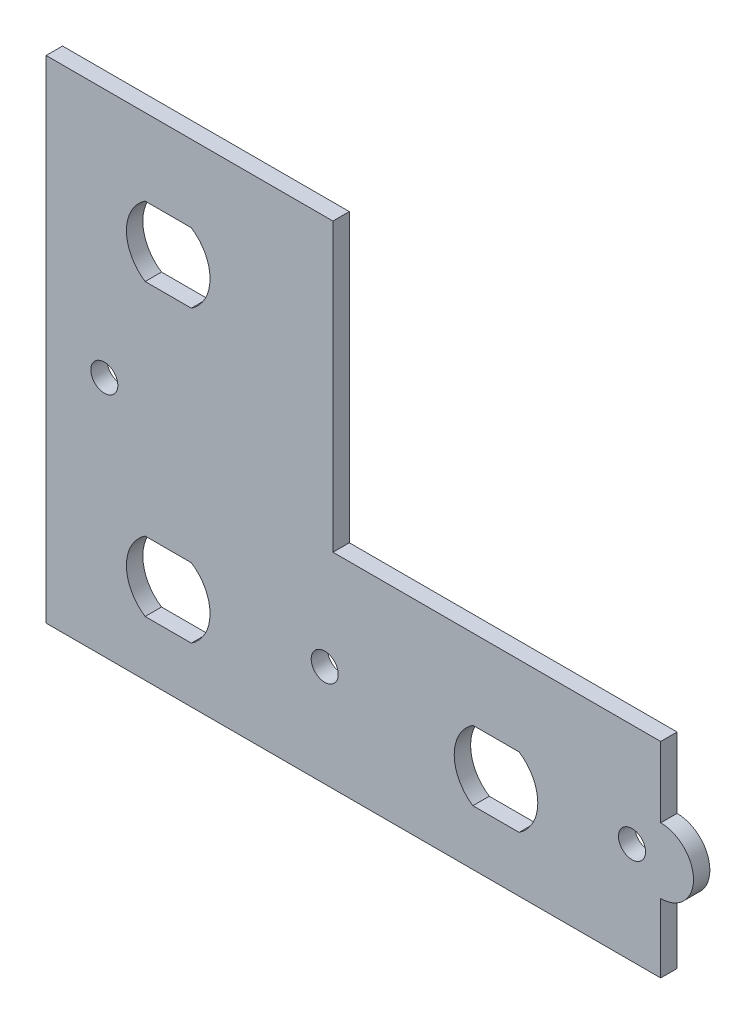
ISO-10303-21;
HEADER;
FILE_DESCRIPTION(('STEP AP214'),'2;1');
FILE_NAME('part.step','',(''),(''),'','','');
FILE_SCHEMA(('AUTOMOTIVE_DESIGN { 1 0 10303 214 1 1 1 1 }'));
ENDSEC;
DATA;
#1=APPLICATION_CONTEXT('core data for automotive mechanical design processes');
#2=APPLICATION_PROTOCOL_DEFINITION('international standard','automotive_design',2000,#1);
#3=PRODUCT_CONTEXT('',#1,'mechanical');
#4=PRODUCT('Part','Part','',(#3));
#5=PRODUCT_RELATED_PRODUCT_CATEGORY('part','',(#4));
#6=PRODUCT_DEFINITION_FORMATION('','',#4);
#7=PRODUCT_DEFINITION_CONTEXT('part definition',#1,'design');
#8=PRODUCT_DEFINITION('design','',#6,#7);
#9=PRODUCT_DEFINITION_SHAPE('','',#8);
#10=(LENGTH_UNIT() NAMED_UNIT(*) SI_UNIT(.MILLI.,.METRE.));
#11=(NAMED_UNIT(*) PLANE_ANGLE_UNIT() SI_UNIT($,.RADIAN.));
#12=(NAMED_UNIT(*) SI_UNIT($,.STERADIAN.) SOLID_ANGLE_UNIT());
#13=UNCERTAINTY_MEASURE_WITH_UNIT(LENGTH_MEASURE(1.E-05),#10,'distance_accuracy_value','');
#14=(GEOMETRIC_REPRESENTATION_CONTEXT(3) GLOBAL_UNCERTAINTY_ASSIGNED_CONTEXT((#13)) GLOBAL_UNIT_ASSIGNED_CONTEXT((#10,
#11,#12)) REPRESENTATION_CONTEXT('',''));
#15=CARTESIAN_POINT('',(0.,0.,0.));
#16=DIRECTION('',(0.,0.,1.));
#17=DIRECTION('',(1.,0.,0.));
#18=AXIS2_PLACEMENT_3D('',#15,#16,#17);
#19=CARTESIAN_POINT('',(75.,-27.3592901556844,-16.1023866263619));
#20=DIRECTION('',(-1.,0.,0.));
#21=DIRECTION('',(0.,0.,1.));
#22=AXIS2_PLACEMENT_3D('',#19,#20,#21);
#23=PLANE('',#22);
#24=DIRECTION('',(0.,-1.,0.));
#25=VECTOR('',#24,1.);
#26=CARTESIAN_POINT('',(75.,32.6407098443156,-18.1023866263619));
#27=LINE('',#26,#25);
#28=CARTESIAN_POINT('',(75.,-18.9592901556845,-18.1023866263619));
#29=VERTEX_POINT('',#28);
#30=CARTESIAN_POINT('',(75.,-27.3592901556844,-18.1023866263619));
#31=VERTEX_POINT('',#30);
#32=EDGE_CURVE('E62',#29,#31,#27,.T.);
#33=ORIENTED_EDGE('',*,*,#32,.F.);
#34=DIRECTION('',(0.,0.,1.));
#35=VECTOR('',#34,1.);
#36=CARTESIAN_POINT('',(75.,-18.9592901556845,-18.1023866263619));
#37=LINE('',#36,#35);
#38=CARTESIAN_POINT('',(75.,-18.9592901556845,-16.1023866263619));
#39=VERTEX_POINT('',#38);
#40=EDGE_CURVE('E185',#29,#39,#37,.T.);
#41=ORIENTED_EDGE('',*,*,#40,.T.);
#42=DIRECTION('',(0.,-1.,0.));
#43=VECTOR('',#42,1.);
#44=CARTESIAN_POINT('',(75.,32.6407098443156,-16.1023866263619));
#45=LINE('',#44,#43);
#46=CARTESIAN_POINT('',(75.,-27.3592901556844,-16.1023866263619));
#47=VERTEX_POINT('',#46);
#48=EDGE_CURVE('E177',#39,#47,#45,.T.);
#49=ORIENTED_EDGE('',*,*,#48,.T.);
#50=DIRECTION('',(0.,0.,1.));
#51=VECTOR('',#50,1.);
#52=CARTESIAN_POINT('',(75.,-27.3592901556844,-18.1023866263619));
#53=LINE('',#52,#51);
#54=EDGE_CURVE('E282',#31,#47,#53,.T.);
#55=ORIENTED_EDGE('',*,*,#54,.F.);
#56=EDGE_LOOP('',(#33,#41,#49,#55));
#57=FACE_BOUND('',#56,.T.);
#58=ADVANCED_FACE('F37',(#57),#23,.F.);
#59=CARTESIAN_POINT('',(75.,32.6407098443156,-16.1023866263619));
#60=DIRECTION('',(0.,0.,-1.));
#61=DIRECTION('',(0.,1.,0.));
#62=AXIS2_PLACEMENT_3D('',#59,#60,#61);
#63=PLANE('',#62);
#64=CARTESIAN_POINT('',(71.5,-14.9592901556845,-16.1023866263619));
#65=DIRECTION('',(0.,0.,1.));
#66=DIRECTION('',(1.,0.,0.));
#67=AXIS2_PLACEMENT_3D('',#64,#65,#66);
#68=CIRCLE('',#67,1.65);
#69=CARTESIAN_POINT('',(73.15,-14.9592901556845,-16.1023866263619));
#70=VERTEX_POINT('',#69);
#71=EDGE_CURVE('E189',#70,#70,#68,.T.);
#72=ORIENTED_EDGE('',*,*,#71,.F.);
#73=EDGE_LOOP('',(#72));
#74=FACE_BOUND('',#73,.T.);
#75=CARTESIAN_POINT('',(34.,-14.9592901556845,-16.1023866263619));
#76=DIRECTION('',(0.,0.,1.));
#77=DIRECTION('',(1.,0.,0.));
#78=AXIS2_PLACEMENT_3D('',#75,#76,#77);
#79=CIRCLE('',#78,1.65);
#80=CARTESIAN_POINT('',(35.65,-14.9592901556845,-16.1023866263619));
#81=VERTEX_POINT('',#80);
#82=EDGE_CURVE('E200',#81,#81,#79,.T.);
#83=ORIENTED_EDGE('',*,*,#82,.F.);
#84=EDGE_LOOP('',(#83));
#85=FACE_BOUND('',#84,.T.);
#86=DIRECTION('',(1.,0.,0.));
#87=VECTOR('',#86,1.);
#88=CARTESIAN_POINT('',(52.0808689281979,-20.6092901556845,-16.1023866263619));
#89=LINE('',#88,#87);
#90=CARTESIAN_POINT('',(52.0808689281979,-20.6092901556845,-16.1023866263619));
#91=VERTEX_POINT('',#90);
#92=CARTESIAN_POINT('',(57.7191310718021,-20.6092901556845,-16.1023866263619));
#93=VERTEX_POINT('',#92);
#94=EDGE_CURVE('E206',#91,#93,#89,.T.);
#95=ORIENTED_EDGE('',*,*,#94,.F.);
#96=CARTESIAN_POINT('',(54.9,-16.3592901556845,-16.1023866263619));
#97=DIRECTION('',(0.,0.,1.));
#98=DIRECTION('',(1.,0.,0.));
#99=AXIS2_PLACEMENT_3D('',#96,#97,#98);
#100=CIRCLE('',#99,5.1);
#101=CARTESIAN_POINT('',(52.0808689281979,-12.1092901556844,-16.1023866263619));
#102=VERTEX_POINT('',#101);
#103=EDGE_CURVE('E204',#102,#91,#100,.T.);
#104=ORIENTED_EDGE('',*,*,#103,.F.);
#105=DIRECTION('',(-1.,0.,0.));
#106=VECTOR('',#105,1.);
#107=CARTESIAN_POINT('',(52.0808689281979,-12.1092901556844,-16.1023866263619));
#108=LINE('',#107,#106);
#109=CARTESIAN_POINT('',(57.7191310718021,-12.1092901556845,-16.1023866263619));
#110=VERTEX_POINT('',#109);
#111=EDGE_CURVE('E212',#110,#102,#108,.T.);
#112=ORIENTED_EDGE('',*,*,#111,.F.);
#113=CARTESIAN_POINT('',(54.9,-16.3592901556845,-16.1023866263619));
#114=DIRECTION('',(0.,0.,1.));
#115=DIRECTION('',(1.,0.,0.));
#116=AXIS2_PLACEMENT_3D('',#113,#114,#115);
#117=CIRCLE('',#116,5.1);
#118=EDGE_CURVE('E209',#93,#110,#117,.T.);
#119=ORIENTED_EDGE('',*,*,#118,.F.);
#120=EDGE_LOOP('',(#95,#104,#112,#119));
#121=FACE_BOUND('',#120,.T.);
#122=DIRECTION('',(1.,0.,0.));
#123=VECTOR('',#122,1.);
#124=CARTESIAN_POINT('',(12.0808689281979,-20.6092901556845,-16.1023866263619));
#125=LINE('',#124,#123);
#126=CARTESIAN_POINT('',(12.0808689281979,-20.6092901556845,-16.1023866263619));
#127=VERTEX_POINT('',#126);
#128=CARTESIAN_POINT('',(17.7191310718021,-20.6092901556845,-16.1023866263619));
#129=VERTEX_POINT('',#128);
#130=EDGE_CURVE('E226',#127,#129,#125,.T.);
#131=ORIENTED_EDGE('',*,*,#130,.F.);
#132=CARTESIAN_POINT('',(14.9,-16.3592901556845,-16.1023866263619));
#133=DIRECTION('',(0.,0.,1.));
#134=DIRECTION('',(1.,0.,0.));
#135=AXIS2_PLACEMENT_3D('',#132,#133,#134);
#136=CIRCLE('',#135,5.1);
#137=CARTESIAN_POINT('',(12.0808689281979,-12.1092901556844,-16.1023866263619));
#138=VERTEX_POINT('',#137);
#139=EDGE_CURVE('E218',#138,#127,#136,.T.);
#140=ORIENTED_EDGE('',*,*,#139,.F.);
#141=DIRECTION('',(-1.,0.,0.));
#142=VECTOR('',#141,1.);
#143=CARTESIAN_POINT('',(12.0808689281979,-12.1092901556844,-16.1023866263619));
#144=LINE('',#143,#142);
#145=CARTESIAN_POINT('',(17.7191310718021,-12.1092901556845,-16.1023866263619));
#146=VERTEX_POINT('',#145);
#147=EDGE_CURVE('E232',#146,#138,#144,.T.);
#148=ORIENTED_EDGE('',*,*,#147,.F.);
#149=CARTESIAN_POINT('',(14.9,-16.3592901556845,-16.1023866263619));
#150=DIRECTION('',(0.,0.,1.));
#151=DIRECTION('',(1.,0.,0.));
#152=AXIS2_PLACEMENT_3D('',#149,#150,#151);
#153=CIRCLE('',#152,5.1);
#154=EDGE_CURVE('E229',#129,#146,#153,.T.);
#155=ORIENTED_EDGE('',*,*,#154,.F.);
#156=EDGE_LOOP('',(#131,#140,#148,#155));
#157=FACE_BOUND('',#156,.T.);
#158=CARTESIAN_POINT('',(7.1,2.14070984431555,-16.1023866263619));
#159=DIRECTION('',(0.,0.,1.));
#160=DIRECTION('',(1.,0.,0.));
#161=AXIS2_PLACEMENT_3D('',#158,#159,#160);
#162=CIRCLE('',#161,1.65);
#163=CARTESIAN_POINT('',(8.75,2.14070984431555,-16.1023866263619));
#164=VERTEX_POINT('',#163);
#165=EDGE_CURVE('E238',#164,#164,#162,.T.);
#166=ORIENTED_EDGE('',*,*,#165,.F.);
#167=EDGE_LOOP('',(#166));
#168=FACE_BOUND('',#167,.T.);
#169=DIRECTION('',(1.,0.,0.));
#170=VECTOR('',#169,1.);
#171=CARTESIAN_POINT('',(12.0808689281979,14.7907098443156,-16.1023866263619));
#172=LINE('',#171,#170);
#173=CARTESIAN_POINT('',(12.0808689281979,14.7907098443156,-16.1023866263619));
#174=VERTEX_POINT('',#173);
#175=CARTESIAN_POINT('',(17.7191310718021,14.7907098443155,-16.1023866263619));
#176=VERTEX_POINT('',#175);
#177=EDGE_CURVE('E250',#174,#176,#172,.T.);
#178=ORIENTED_EDGE('',*,*,#177,.F.);
#179=CARTESIAN_POINT('',(14.9,19.0407098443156,-16.1023866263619));
#180=DIRECTION('',(0.,0.,1.));
#181=DIRECTION('',(1.,0.,0.));
#182=AXIS2_PLACEMENT_3D('',#179,#180,#181);
#183=CIRCLE('',#182,5.1);
#184=CARTESIAN_POINT('',(12.0808689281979,23.2907098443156,-16.1023866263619));
#185=VERTEX_POINT('',#184);
#186=EDGE_CURVE('E248',#185,#174,#183,.T.);
#187=ORIENTED_EDGE('',*,*,#186,.F.);
#188=DIRECTION('',(-1.,0.,0.));
#189=VECTOR('',#188,1.);
#190=CARTESIAN_POINT('',(12.0808689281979,23.2907098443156,-16.1023866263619));
#191=LINE('',#190,#189);
#192=CARTESIAN_POINT('',(17.7191310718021,23.2907098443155,-16.1023866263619));
#193=VERTEX_POINT('',#192);
#194=EDGE_CURVE('E256',#193,#185,#191,.T.);
#195=ORIENTED_EDGE('',*,*,#194,.F.);
#196=CARTESIAN_POINT('',(14.9,19.0407098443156,-16.1023866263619));
#197=DIRECTION('',(0.,0.,1.));
#198=DIRECTION('',(1.,0.,0.));
#199=AXIS2_PLACEMENT_3D('',#196,#197,#198);
#200=CIRCLE('',#199,5.1);
#201=EDGE_CURVE('E253',#176,#193,#200,.T.);
#202=ORIENTED_EDGE('',*,*,#201,.F.);
#203=EDGE_LOOP('',(#178,#187,#195,#202));
#204=FACE_BOUND('',#203,.T.);
#205=CARTESIAN_POINT('',(75.,-2.35929015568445,-16.1023866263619));
#206=VERTEX_POINT('',#205);
#207=CARTESIAN_POINT('',(75.,-10.9592901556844,-16.1023866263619));
#208=VERTEX_POINT('',#207);
#209=EDGE_CURVE('E54',#206,#208,#45,.T.);
#210=ORIENTED_EDGE('',*,*,#209,.F.);
#211=DIRECTION('',(1.,0.,0.));
#212=VECTOR('',#211,1.);
#213=CARTESIAN_POINT('',(75.,-2.35929015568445,-16.1023866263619));
#214=LINE('',#213,#212);
#215=CARTESIAN_POINT('',(35.,-2.35929015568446,-16.1023866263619));
#216=VERTEX_POINT('',#215);
#217=EDGE_CURVE('E271',#216,#206,#214,.T.);
#218=ORIENTED_EDGE('',*,*,#217,.F.);
#219=DIRECTION('',(0.,-1.,0.));
#220=VECTOR('',#219,1.);
#221=CARTESIAN_POINT('',(35.,-2.35929015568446,-16.1023866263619));
#222=LINE('',#221,#220);
#223=CARTESIAN_POINT('',(35.,32.6407098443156,-16.1023866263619));
#224=VERTEX_POINT('',#223);
#225=EDGE_CURVE('E262',#224,#216,#222,.T.);
#226=ORIENTED_EDGE('',*,*,#225,.F.);
#227=DIRECTION('',(-1.,0.,0.));
#228=VECTOR('',#227,1.);
#229=CARTESIAN_POINT('',(75.,32.6407098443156,-16.1023866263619));
#230=LINE('',#229,#228);
#231=CARTESIAN_POINT('',(0.,32.6407098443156,-16.1023866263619));
#232=VERTEX_POINT('',#231);
#233=EDGE_CURVE('E287',#224,#232,#230,.T.);
#234=ORIENTED_EDGE('',*,*,#233,.T.);
#235=DIRECTION('',(0.,-1.,0.));
#236=VECTOR('',#235,1.);
#237=CARTESIAN_POINT('',(0.,32.6407098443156,-16.1023866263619));
#238=LINE('',#237,#236);
#239=CARTESIAN_POINT('',(0.,-27.3592901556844,-16.1023866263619));
#240=VERTEX_POINT('',#239);
#241=EDGE_CURVE('E280',#232,#240,#238,.T.);
#242=ORIENTED_EDGE('',*,*,#241,.T.);
#243=DIRECTION('',(-1.,0.,0.));
#244=VECTOR('',#243,1.);
#245=CARTESIAN_POINT('',(75.,-27.3592901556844,-16.1023866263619));
#246=LINE('',#245,#244);
#247=EDGE_CURVE('E181',#47,#240,#246,.T.);
#248=ORIENTED_EDGE('',*,*,#247,.F.);
#249=ORIENTED_EDGE('',*,*,#48,.F.);
#250=CARTESIAN_POINT('',(75.,-14.9592901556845,-16.1023866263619));
#251=DIRECTION('',(0.,0.,1.));
#252=DIRECTION('',(1.,0.,0.));
#253=AXIS2_PLACEMENT_3D('',#250,#251,#252);
#254=CIRCLE('',#253,4.);
#255=EDGE_CURVE('E179',#39,#208,#254,.T.);
#256=ORIENTED_EDGE('',*,*,#255,.T.);
#257=EDGE_LOOP('',(#210,#218,#226,#234,#242,#248,#249,#256));
#258=FACE_BOUND('',#257,.T.);
#259=ADVANCED_FACE('F39',(#74,#85,#121,#157,#168,#204,#258),#63,.F.);
#260=CARTESIAN_POINT('',(75.,-27.3592901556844,-18.1023866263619));
#261=DIRECTION('',(0.,-1.,0.));
#262=DIRECTION('',(0.,0.,-1.));
#263=AXIS2_PLACEMENT_3D('',#260,#261,#262);
#264=PLANE('',#263);
#265=DIRECTION('',(0.,0.,1.));
#266=VECTOR('',#265,1.);
#267=CARTESIAN_POINT('',(0.,-27.3592901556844,-18.1023866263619));
#268=LINE('',#267,#266);
#269=CARTESIAN_POINT('',(0.,-27.3592901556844,-18.1023866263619));
#270=VERTEX_POINT('',#269);
#271=EDGE_CURVE('E289',#270,#240,#268,.T.);
#272=ORIENTED_EDGE('',*,*,#271,.F.);
#273=DIRECTION('',(-1.,0.,0.));
#274=VECTOR('',#273,1.);
#275=CARTESIAN_POINT('',(75.,-27.3592901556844,-18.1023866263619));
#276=LINE('',#275,#274);
#277=EDGE_CURVE('E300',#31,#270,#276,.T.);
#278=ORIENTED_EDGE('',*,*,#277,.F.);
#279=ORIENTED_EDGE('',*,*,#54,.T.);
#280=ORIENTED_EDGE('',*,*,#247,.T.);
#281=EDGE_LOOP('',(#272,#278,#279,#280));
#282=FACE_BOUND('',#281,.T.);
#283=ADVANCED_FACE('F340',(#282),#264,.T.);
#284=CARTESIAN_POINT('',(75.,32.6407098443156,-18.1023866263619));
#285=DIRECTION('',(0.,0.,-1.));
#286=DIRECTION('',(0.,1.,0.));
#287=AXIS2_PLACEMENT_3D('',#284,#285,#286);
#288=PLANE('',#287);
#289=CARTESIAN_POINT('',(71.5,-14.9592901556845,-18.1023866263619));
#290=DIRECTION('',(0.,0.,-1.));
#291=DIRECTION('',(0.,1.,0.));
#292=AXIS2_PLACEMENT_3D('',#289,#290,#291);
#293=CIRCLE('',#292,1.65);
#294=CARTESIAN_POINT('',(71.5,-13.3092901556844,-18.1023866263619));
#295=VERTEX_POINT('',#294);
#296=EDGE_CURVE('E41',#295,#295,#293,.T.);
#297=ORIENTED_EDGE('',*,*,#296,.F.);
#298=EDGE_LOOP('',(#297));
#299=FACE_BOUND('',#298,.T.);
#300=CARTESIAN_POINT('',(34.,-14.9592901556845,-18.1023866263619));
#301=DIRECTION('',(0.,0.,-1.));
#302=DIRECTION('',(0.,1.,0.));
#303=AXIS2_PLACEMENT_3D('',#300,#301,#302);
#304=CIRCLE('',#303,1.65);
#305=CARTESIAN_POINT('',(34.,-13.3092901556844,-18.1023866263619));
#306=VERTEX_POINT('',#305);
#307=EDGE_CURVE('E203',#306,#306,#304,.T.);
#308=ORIENTED_EDGE('',*,*,#307,.F.);
#309=EDGE_LOOP('',(#308));
#310=FACE_BOUND('',#309,.T.);
#311=CARTESIAN_POINT('',(54.9,-16.3592901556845,-18.1023866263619));
#312=DIRECTION('',(0.,0.,-1.));
#313=DIRECTION('',(0.,1.,0.));
#314=AXIS2_PLACEMENT_3D('',#311,#312,#313);
#315=CIRCLE('',#314,5.1);
#316=CARTESIAN_POINT('',(52.0808689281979,-20.6092901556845,-18.1023866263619));
#317=VERTEX_POINT('',#316);
#318=CARTESIAN_POINT('',(52.0808689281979,-12.1092901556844,-18.1023866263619));
#319=VERTEX_POINT('',#318);
#320=EDGE_CURVE('E11',#317,#319,#315,.T.);
#321=ORIENTED_EDGE('',*,*,#320,.F.);
#322=DIRECTION('',(-1.,0.,0.));
#323=VECTOR('',#322,1.);
#324=CARTESIAN_POINT('',(75.,-20.6092901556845,-18.1023866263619));
#325=LINE('',#324,#323);
#326=CARTESIAN_POINT('',(57.7191310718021,-20.6092901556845,-18.1023866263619));
#327=VERTEX_POINT('',#326);
#328=EDGE_CURVE('E325',#327,#317,#325,.T.);
#329=ORIENTED_EDGE('',*,*,#328,.F.);
#330=CARTESIAN_POINT('',(54.9,-16.3592901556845,-18.1023866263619));
#331=DIRECTION('',(0.,0.,-1.));
#332=DIRECTION('',(0.,1.,0.));
#333=AXIS2_PLACEMENT_3D('',#330,#331,#332);
#334=CIRCLE('',#333,5.1);
#335=CARTESIAN_POINT('',(57.7191310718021,-12.1092901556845,-18.1023866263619));
#336=VERTEX_POINT('',#335);
#337=EDGE_CURVE('E327',#336,#327,#334,.T.);
#338=ORIENTED_EDGE('',*,*,#337,.F.);
#339=DIRECTION('',(1.,0.,0.));
#340=VECTOR('',#339,1.);
#341=CARTESIAN_POINT('',(75.,-12.1092901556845,-18.1023866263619));
#342=LINE('',#341,#340);
#343=EDGE_CURVE('E46',#319,#336,#342,.T.);
#344=ORIENTED_EDGE('',*,*,#343,.F.);
#345=EDGE_LOOP('',(#321,#329,#338,#344));
#346=FACE_BOUND('',#345,.T.);
#347=CARTESIAN_POINT('',(14.9,-16.3592901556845,-18.1023866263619));
#348=DIRECTION('',(0.,0.,-1.));
#349=DIRECTION('',(0.,1.,0.));
#350=AXIS2_PLACEMENT_3D('',#347,#348,#349);
#351=CIRCLE('',#350,5.1);
#352=CARTESIAN_POINT('',(12.0808689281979,-20.6092901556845,-18.1023866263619));
#353=VERTEX_POINT('',#352);
#354=CARTESIAN_POINT('',(12.0808689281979,-12.1092901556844,-18.1023866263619));
#355=VERTEX_POINT('',#354);
#356=EDGE_CURVE('E323',#353,#355,#351,.T.);
#357=ORIENTED_EDGE('',*,*,#356,.F.);
#358=DIRECTION('',(-1.,0.,0.));
#359=VECTOR('',#358,1.);
#360=CARTESIAN_POINT('',(75.,-20.6092901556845,-18.1023866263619));
#361=LINE('',#360,#359);
#362=CARTESIAN_POINT('',(17.7191310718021,-20.6092901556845,-18.1023866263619));
#363=VERTEX_POINT('',#362);
#364=EDGE_CURVE('E314',#363,#353,#361,.T.);
#365=ORIENTED_EDGE('',*,*,#364,.F.);
#366=CARTESIAN_POINT('',(14.9,-16.3592901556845,-18.1023866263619));
#367=DIRECTION('',(0.,0.,-1.));
#368=DIRECTION('',(0.,1.,0.));
#369=AXIS2_PLACEMENT_3D('',#366,#367,#368);
#370=CIRCLE('',#369,5.1);
#371=CARTESIAN_POINT('',(17.7191310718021,-12.1092901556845,-18.1023866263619));
#372=VERTEX_POINT('',#371);
#373=EDGE_CURVE('E318',#372,#363,#370,.T.);
#374=ORIENTED_EDGE('',*,*,#373,.F.);
#375=DIRECTION('',(1.,0.,0.));
#376=VECTOR('',#375,1.);
#377=CARTESIAN_POINT('',(75.,-12.1092901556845,-18.1023866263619));
#378=LINE('',#377,#376);
#379=EDGE_CURVE('E321',#355,#372,#378,.T.);
#380=ORIENTED_EDGE('',*,*,#379,.F.);
#381=EDGE_LOOP('',(#357,#365,#374,#380));
#382=FACE_BOUND('',#381,.T.);
#383=CARTESIAN_POINT('',(7.1,2.14070984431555,-18.1023866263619));
#384=DIRECTION('',(0.,0.,-1.));
#385=DIRECTION('',(0.,1.,0.));
#386=AXIS2_PLACEMENT_3D('',#383,#384,#385);
#387=CIRCLE('',#386,1.65);
#388=CARTESIAN_POINT('',(7.1,3.79070984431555,-18.1023866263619));
#389=VERTEX_POINT('',#388);
#390=EDGE_CURVE('E247',#389,#389,#387,.T.);
#391=ORIENTED_EDGE('',*,*,#390,.F.);
#392=EDGE_LOOP('',(#391));
#393=FACE_BOUND('',#392,.T.);
#394=CARTESIAN_POINT('',(14.9,19.0407098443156,-18.1023866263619));
#395=DIRECTION('',(0.,0.,-1.));
#396=DIRECTION('',(0.,1.,0.));
#397=AXIS2_PLACEMENT_3D('',#394,#395,#396);
#398=CIRCLE('',#397,5.1);
#399=CARTESIAN_POINT('',(12.0808689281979,14.7907098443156,-18.1023866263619));
#400=VERTEX_POINT('',#399);
#401=CARTESIAN_POINT('',(12.0808689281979,23.2907098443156,-18.1023866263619));
#402=VERTEX_POINT('',#401);
#403=EDGE_CURVE('E312',#400,#402,#398,.T.);
#404=ORIENTED_EDGE('',*,*,#403,.F.);
#405=DIRECTION('',(-1.,0.,0.));
#406=VECTOR('',#405,1.);
#407=CARTESIAN_POINT('',(75.,14.7907098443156,-18.1023866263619));
#408=LINE('',#407,#406);
#409=CARTESIAN_POINT('',(17.7191310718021,14.7907098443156,-18.1023866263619));
#410=VERTEX_POINT('',#409);
#411=EDGE_CURVE('E305',#410,#400,#408,.T.);
#412=ORIENTED_EDGE('',*,*,#411,.F.);
#413=CARTESIAN_POINT('',(14.9,19.0407098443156,-18.1023866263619));
#414=DIRECTION('',(0.,0.,-1.));
#415=DIRECTION('',(0.,1.,0.));
#416=AXIS2_PLACEMENT_3D('',#413,#414,#415);
#417=CIRCLE('',#416,5.1);
#418=CARTESIAN_POINT('',(17.7191310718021,23.2907098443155,-18.1023866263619));
#419=VERTEX_POINT('',#418);
#420=EDGE_CURVE('E307',#419,#410,#417,.T.);
#421=ORIENTED_EDGE('',*,*,#420,.F.);
#422=DIRECTION('',(1.,0.,0.));
#423=VECTOR('',#422,1.);
#424=CARTESIAN_POINT('',(75.,23.2907098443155,-18.1023866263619));
#425=LINE('',#424,#423);
#426=EDGE_CURVE('E310',#402,#419,#425,.T.);
#427=ORIENTED_EDGE('',*,*,#426,.F.);
#428=EDGE_LOOP('',(#404,#412,#421,#427));
#429=FACE_BOUND('',#428,.T.);
#430=DIRECTION('',(-1.,0.,0.));
#431=VECTOR('',#430,1.);
#432=CARTESIAN_POINT('',(75.,-2.35929015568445,-18.1023866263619));
#433=LINE('',#432,#431);
#434=CARTESIAN_POINT('',(75.,-2.35929015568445,-18.1023866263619));
#435=VERTEX_POINT('',#434);
#436=CARTESIAN_POINT('',(35.,-2.35929015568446,-18.1023866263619));
#437=VERTEX_POINT('',#436);
#438=EDGE_CURVE('E276',#435,#437,#433,.T.);
#439=ORIENTED_EDGE('',*,*,#438,.F.);
#440=CARTESIAN_POINT('',(75.,-10.9592901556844,-18.1023866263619));
#441=VERTEX_POINT('',#440);
#442=EDGE_CURVE('E284',#435,#441,#27,.T.);
#443=ORIENTED_EDGE('',*,*,#442,.T.);
#444=CARTESIAN_POINT('',(75.,-14.9592901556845,-18.1023866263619));
#445=DIRECTION('',(0.,0.,1.));
#446=DIRECTION('',(1.,0.,0.));
#447=AXIS2_PLACEMENT_3D('',#444,#445,#446);
#448=CIRCLE('',#447,4.);
#449=EDGE_CURVE('E193',#29,#441,#448,.T.);
#450=ORIENTED_EDGE('',*,*,#449,.F.);
#451=ORIENTED_EDGE('',*,*,#32,.T.);
#452=ORIENTED_EDGE('',*,*,#277,.T.);
#453=DIRECTION('',(0.,-1.,0.));
#454=VECTOR('',#453,1.);
#455=CARTESIAN_POINT('',(0.,32.6407098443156,-18.1023866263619));
#456=LINE('',#455,#454);
#457=CARTESIAN_POINT('',(0.,32.6407098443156,-18.1023866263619));
#458=VERTEX_POINT('',#457);
#459=EDGE_CURVE('E292',#458,#270,#456,.T.);
#460=ORIENTED_EDGE('',*,*,#459,.F.);
#461=DIRECTION('',(-1.,0.,0.));
#462=VECTOR('',#461,1.);
#463=CARTESIAN_POINT('',(75.,32.6407098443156,-18.1023866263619));
#464=LINE('',#463,#462);
#465=CARTESIAN_POINT('',(35.,32.6407098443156,-18.1023866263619));
#466=VERTEX_POINT('',#465);
#467=EDGE_CURVE('E298',#466,#458,#464,.T.);
#468=ORIENTED_EDGE('',*,*,#467,.F.);
#469=DIRECTION('',(0.,1.,0.));
#470=VECTOR('',#469,1.);
#471=CARTESIAN_POINT('',(35.,32.6407098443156,-18.1023866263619));
#472=LINE('',#471,#470);
#473=EDGE_CURVE('E279',#437,#466,#472,.T.);
#474=ORIENTED_EDGE('',*,*,#473,.F.);
#475=EDGE_LOOP('',(#439,#443,#450,#451,#452,#460,#468,#474));
#476=FACE_BOUND('',#475,.T.);
#477=ADVANCED_FACE('F336',(#299,#310,#346,#382,#393,#429,#476),#288,.T.);
#478=CARTESIAN_POINT('',(75.,32.6407098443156,-16.1023866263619));
#479=DIRECTION('',(0.,1.,0.));
#480=DIRECTION('',(0.,0.,1.));
#481=AXIS2_PLACEMENT_3D('',#478,#479,#480);
#482=PLANE('',#481);
#483=DIRECTION('',(0.,0.,1.));
#484=VECTOR('',#483,1.);
#485=CARTESIAN_POINT('',(35.,32.6407098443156,-26.1023866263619));
#486=LINE('',#485,#484);
#487=EDGE_CURVE('E273',#466,#224,#486,.T.);
#488=ORIENTED_EDGE('',*,*,#487,.F.);
#489=ORIENTED_EDGE('',*,*,#467,.T.);
#490=DIRECTION('',(0.,0.,-1.));
#491=VECTOR('',#490,1.);
#492=CARTESIAN_POINT('',(0.,32.6407098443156,-16.1023866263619));
#493=LINE('',#492,#491);
#494=EDGE_CURVE('E183',#232,#458,#493,.T.);
#495=ORIENTED_EDGE('',*,*,#494,.F.);
#496=ORIENTED_EDGE('',*,*,#233,.F.);
#497=EDGE_LOOP('',(#488,#489,#495,#496));
#498=FACE_BOUND('',#497,.T.);
#499=ADVANCED_FACE('F339',(#498),#482,.T.);
#500=ORIENTED_EDGE('',*,*,#209,.T.);
#501=DIRECTION('',(0.,0.,1.));
#502=VECTOR('',#501,1.);
#503=CARTESIAN_POINT('',(75.,-10.9592901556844,-18.1023866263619));
#504=LINE('',#503,#502);
#505=EDGE_CURVE('E190',#441,#208,#504,.T.);
#506=ORIENTED_EDGE('',*,*,#505,.F.);
#507=ORIENTED_EDGE('',*,*,#442,.F.);
#508=DIRECTION('',(0.,0.,1.));
#509=VECTOR('',#508,1.);
#510=CARTESIAN_POINT('',(75.,-2.35929015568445,-16.1023866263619));
#511=LINE('',#510,#509);
#512=EDGE_CURVE('E303',#435,#206,#511,.T.);
#513=ORIENTED_EDGE('',*,*,#512,.T.);
#514=EDGE_LOOP('',(#500,#506,#507,#513));
#515=FACE_BOUND('',#514,.T.);
#516=ADVANCED_FACE('F363',(#515),#23,.F.);
#517=CARTESIAN_POINT('',(0.,-27.3592901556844,-16.1023866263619));
#518=DIRECTION('',(-1.,0.,0.));
#519=DIRECTION('',(0.,0.,1.));
#520=AXIS2_PLACEMENT_3D('',#517,#518,#519);
#521=PLANE('',#520);
#522=ORIENTED_EDGE('',*,*,#241,.F.);
#523=ORIENTED_EDGE('',*,*,#494,.T.);
#524=ORIENTED_EDGE('',*,*,#459,.T.);
#525=ORIENTED_EDGE('',*,*,#271,.T.);
#526=EDGE_LOOP('',(#522,#523,#524,#525));
#527=FACE_BOUND('',#526,.T.);
#528=ADVANCED_FACE('F378',(#527),#521,.T.);
#529=CARTESIAN_POINT('',(75.,-2.35929015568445,-26.1023866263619));
#530=DIRECTION('',(0.,-1.,0.));
#531=DIRECTION('',(1.,0.,0.));
#532=AXIS2_PLACEMENT_3D('',#529,#530,#531);
#533=PLANE('',#532);
#534=ORIENTED_EDGE('',*,*,#438,.T.);
#535=DIRECTION('',(0.,0.,1.));
#536=VECTOR('',#535,1.);
#537=CARTESIAN_POINT('',(35.,-2.35929015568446,-26.1023866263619));
#538=LINE('',#537,#536);
#539=EDGE_CURVE('E274',#437,#216,#538,.T.);
#540=ORIENTED_EDGE('',*,*,#539,.T.);
#541=ORIENTED_EDGE('',*,*,#217,.T.);
#542=ORIENTED_EDGE('',*,*,#512,.F.);
#543=EDGE_LOOP('',(#534,#540,#541,#542));
#544=FACE_BOUND('',#543,.T.);
#545=ADVANCED_FACE('F367',(#544),#533,.F.);
#546=CARTESIAN_POINT('',(35.,-2.35929015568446,-26.1023866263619));
#547=DIRECTION('',(-1.,0.,0.));
#548=DIRECTION('',(0.,0.,1.));
#549=AXIS2_PLACEMENT_3D('',#546,#547,#548);
#550=PLANE('',#549);
#551=ORIENTED_EDGE('',*,*,#473,.T.);
#552=ORIENTED_EDGE('',*,*,#487,.T.);
#553=ORIENTED_EDGE('',*,*,#225,.T.);
#554=ORIENTED_EDGE('',*,*,#539,.F.);
#555=EDGE_LOOP('',(#551,#552,#553,#554));
#556=FACE_BOUND('',#555,.T.);
#557=ADVANCED_FACE('F369',(#556),#550,.F.);
#558=CARTESIAN_POINT('',(14.9,19.0407098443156,-26.1023866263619));
#559=DIRECTION('',(0.,0.,1.));
#560=DIRECTION('',(1.,0.,0.));
#561=AXIS2_PLACEMENT_3D('',#558,#559,#560);
#562=CYLINDRICAL_SURFACE('',#561,5.1);
#563=ORIENTED_EDGE('',*,*,#403,.T.);
#564=DIRECTION('',(0.,0.,1.));
#565=VECTOR('',#564,1.);
#566=CARTESIAN_POINT('',(12.0808689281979,23.2907098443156,-26.1023866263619));
#567=LINE('',#566,#565);
#568=EDGE_CURVE('E260',#402,#185,#567,.T.);
#569=ORIENTED_EDGE('',*,*,#568,.T.);
#570=ORIENTED_EDGE('',*,*,#186,.T.);
#571=DIRECTION('',(0.,0.,1.));
#572=VECTOR('',#571,1.);
#573=CARTESIAN_POINT('',(12.0808689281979,14.7907098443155,-26.1023866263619));
#574=LINE('',#573,#572);
#575=EDGE_CURVE('E259',#400,#174,#574,.T.);
#576=ORIENTED_EDGE('',*,*,#575,.F.);
#577=EDGE_LOOP('',(#563,#569,#570,#576));
#578=FACE_BOUND('',#577,.T.);
#579=ADVANCED_FACE('F483',(#578),#562,.F.);
#580=CARTESIAN_POINT('',(12.0808689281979,23.2907098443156,-26.1023866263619));
#581=DIRECTION('',(0.,1.,0.));
#582=DIRECTION('',(-1.,0.,0.));
#583=AXIS2_PLACEMENT_3D('',#580,#581,#582);
#584=PLANE('',#583);
#585=ORIENTED_EDGE('',*,*,#426,.T.);
#586=DIRECTION('',(0.,0.,1.));
#587=VECTOR('',#586,1.);
#588=CARTESIAN_POINT('',(17.7191310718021,23.2907098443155,-26.1023866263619));
#589=LINE('',#588,#587);
#590=EDGE_CURVE('E263',#419,#193,#589,.T.);
#591=ORIENTED_EDGE('',*,*,#590,.T.);
#592=ORIENTED_EDGE('',*,*,#194,.T.);
#593=ORIENTED_EDGE('',*,*,#568,.F.);
#594=EDGE_LOOP('',(#585,#591,#592,#593));
#595=FACE_BOUND('',#594,.T.);
#596=ADVANCED_FACE('F490',(#595),#584,.F.);
#597=CARTESIAN_POINT('',(14.9,19.0407098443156,-26.1023866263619));
#598=DIRECTION('',(0.,0.,1.));
#599=DIRECTION('',(1.,0.,0.));
#600=AXIS2_PLACEMENT_3D('',#597,#598,#599);
#601=CYLINDRICAL_SURFACE('',#600,5.1);
#602=ORIENTED_EDGE('',*,*,#420,.T.);
#603=DIRECTION('',(0.,0.,1.));
#604=VECTOR('',#603,1.);
#605=CARTESIAN_POINT('',(17.7191310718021,14.7907098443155,-26.1023866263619));
#606=LINE('',#605,#604);
#607=EDGE_CURVE('E265',#410,#176,#606,.T.);
#608=ORIENTED_EDGE('',*,*,#607,.T.);
#609=ORIENTED_EDGE('',*,*,#201,.T.);
#610=ORIENTED_EDGE('',*,*,#590,.F.);
#611=EDGE_LOOP('',(#602,#608,#609,#610));
#612=FACE_BOUND('',#611,.T.);
#613=ADVANCED_FACE('F499',(#612),#601,.F.);
#614=CARTESIAN_POINT('',(12.0808689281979,14.7907098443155,-26.1023866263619));
#615=DIRECTION('',(0.,-1.,0.));
#616=DIRECTION('',(0.,0.,-1.));
#617=AXIS2_PLACEMENT_3D('',#614,#615,#616);
#618=PLANE('',#617);
#619=ORIENTED_EDGE('',*,*,#411,.T.);
#620=ORIENTED_EDGE('',*,*,#575,.T.);
#621=ORIENTED_EDGE('',*,*,#177,.T.);
#622=ORIENTED_EDGE('',*,*,#607,.F.);
#623=EDGE_LOOP('',(#619,#620,#621,#622));
#624=FACE_BOUND('',#623,.T.);
#625=ADVANCED_FACE('F508',(#624),#618,.F.);
#626=CARTESIAN_POINT('',(7.1,2.14070984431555,-26.1023866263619));
#627=DIRECTION('',(0.,0.,1.));
#628=DIRECTION('',(1.,0.,0.));
#629=AXIS2_PLACEMENT_3D('',#626,#627,#628);
#630=CYLINDRICAL_SURFACE('',#629,1.65);
#631=ORIENTED_EDGE('',*,*,#390,.T.);
#632=EDGE_LOOP('',(#631));
#633=FACE_BOUND('',#632,.T.);
#634=ORIENTED_EDGE('',*,*,#165,.T.);
#635=EDGE_LOOP('',(#634));
#636=FACE_BOUND('',#635,.T.);
#637=ADVANCED_FACE('F517',(#633,#636),#630,.F.);
#638=CARTESIAN_POINT('',(14.9,-16.3592901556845,-26.1023866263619));
#639=DIRECTION('',(0.,0.,1.));
#640=DIRECTION('',(1.,0.,0.));
#641=AXIS2_PLACEMENT_3D('',#638,#639,#640);
#642=CYLINDRICAL_SURFACE('',#641,5.1);
#643=ORIENTED_EDGE('',*,*,#356,.T.);
#644=DIRECTION('',(0.,0.,1.));
#645=VECTOR('',#644,1.);
#646=CARTESIAN_POINT('',(12.0808689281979,-12.1092901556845,-26.1023866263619));
#647=LINE('',#646,#645);
#648=EDGE_CURVE('E236',#355,#138,#647,.T.);
#649=ORIENTED_EDGE('',*,*,#648,.T.);
#650=ORIENTED_EDGE('',*,*,#139,.T.);
#651=DIRECTION('',(0.,0.,1.));
#652=VECTOR('',#651,1.);
#653=CARTESIAN_POINT('',(12.0808689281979,-20.6092901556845,-26.1023866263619));
#654=LINE('',#653,#652);
#655=EDGE_CURVE('E235',#353,#127,#654,.T.);
#656=ORIENTED_EDGE('',*,*,#655,.F.);
#657=EDGE_LOOP('',(#643,#649,#650,#656));
#658=FACE_BOUND('',#657,.T.);
#659=ADVANCED_FACE('F526',(#658),#642,.F.);
#660=CARTESIAN_POINT('',(12.0808689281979,-12.1092901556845,-26.1023866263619));
#661=DIRECTION('',(0.,1.,0.));
#662=DIRECTION('',(-1.,0.,0.));
#663=AXIS2_PLACEMENT_3D('',#660,#661,#662);
#664=PLANE('',#663);
#665=ORIENTED_EDGE('',*,*,#379,.T.);
#666=DIRECTION('',(0.,0.,1.));
#667=VECTOR('',#666,1.);
#668=CARTESIAN_POINT('',(17.7191310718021,-12.1092901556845,-26.1023866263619));
#669=LINE('',#668,#667);
#670=EDGE_CURVE('E239',#372,#146,#669,.T.);
#671=ORIENTED_EDGE('',*,*,#670,.T.);
#672=ORIENTED_EDGE('',*,*,#147,.T.);
#673=ORIENTED_EDGE('',*,*,#648,.F.);
#674=EDGE_LOOP('',(#665,#671,#672,#673));
#675=FACE_BOUND('',#674,.T.);
#676=ADVANCED_FACE('F535',(#675),#664,.F.);
#677=CARTESIAN_POINT('',(14.9,-16.3592901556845,-26.1023866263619));
#678=DIRECTION('',(0.,0.,1.));
#679=DIRECTION('',(1.,0.,0.));
#680=AXIS2_PLACEMENT_3D('',#677,#678,#679);
#681=CYLINDRICAL_SURFACE('',#680,5.1);
#682=ORIENTED_EDGE('',*,*,#373,.T.);
#683=DIRECTION('',(0.,0.,1.));
#684=VECTOR('',#683,1.);
#685=CARTESIAN_POINT('',(17.7191310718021,-20.6092901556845,-26.1023866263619));
#686=LINE('',#685,#684);
#687=EDGE_CURVE('E241',#363,#129,#686,.T.);
#688=ORIENTED_EDGE('',*,*,#687,.T.);
#689=ORIENTED_EDGE('',*,*,#154,.T.);
#690=ORIENTED_EDGE('',*,*,#670,.F.);
#691=EDGE_LOOP('',(#682,#688,#689,#690));
#692=FACE_BOUND('',#691,.T.);
#693=ADVANCED_FACE('F544',(#692),#681,.F.);
#694=CARTESIAN_POINT('',(12.0808689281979,-20.6092901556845,-26.1023866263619));
#695=DIRECTION('',(0.,-1.,0.));
#696=DIRECTION('',(0.,0.,-1.));
#697=AXIS2_PLACEMENT_3D('',#694,#695,#696);
#698=PLANE('',#697);
#699=ORIENTED_EDGE('',*,*,#364,.T.);
#700=ORIENTED_EDGE('',*,*,#655,.T.);
#701=ORIENTED_EDGE('',*,*,#130,.T.);
#702=ORIENTED_EDGE('',*,*,#687,.F.);
#703=EDGE_LOOP('',(#699,#700,#701,#702));
#704=FACE_BOUND('',#703,.T.);
#705=ADVANCED_FACE('F553',(#704),#698,.F.);
#706=CARTESIAN_POINT('',(54.9,-16.3592901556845,-26.1023866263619));
#707=DIRECTION('',(0.,0.,1.));
#708=DIRECTION('',(1.,0.,0.));
#709=AXIS2_PLACEMENT_3D('',#706,#707,#708);
#710=CYLINDRICAL_SURFACE('',#709,5.1);
#711=ORIENTED_EDGE('',*,*,#320,.T.);
#712=DIRECTION('',(0.,0.,1.));
#713=VECTOR('',#712,1.);
#714=CARTESIAN_POINT('',(52.0808689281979,-12.1092901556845,-26.1023866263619));
#715=LINE('',#714,#713);
#716=EDGE_CURVE('E216',#319,#102,#715,.T.);
#717=ORIENTED_EDGE('',*,*,#716,.T.);
#718=ORIENTED_EDGE('',*,*,#103,.T.);
#719=DIRECTION('',(0.,0.,1.));
#720=VECTOR('',#719,1.);
#721=CARTESIAN_POINT('',(52.0808689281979,-20.6092901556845,-26.1023866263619));
#722=LINE('',#721,#720);
#723=EDGE_CURVE('E215',#317,#91,#722,.T.);
#724=ORIENTED_EDGE('',*,*,#723,.F.);
#725=EDGE_LOOP('',(#711,#717,#718,#724));
#726=FACE_BOUND('',#725,.T.);
#727=ADVANCED_FACE('F562',(#726),#710,.F.);
#728=CARTESIAN_POINT('',(52.0808689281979,-12.1092901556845,-26.1023866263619));
#729=DIRECTION('',(0.,1.,0.));
#730=DIRECTION('',(-1.,0.,0.));
#731=AXIS2_PLACEMENT_3D('',#728,#729,#730);
#732=PLANE('',#731);
#733=ORIENTED_EDGE('',*,*,#343,.T.);
#734=DIRECTION('',(0.,0.,1.));
#735=VECTOR('',#734,1.);
#736=CARTESIAN_POINT('',(57.7191310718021,-12.1092901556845,-26.1023866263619));
#737=LINE('',#736,#735);
#738=EDGE_CURVE('E219',#336,#110,#737,.T.);
#739=ORIENTED_EDGE('',*,*,#738,.T.);
#740=ORIENTED_EDGE('',*,*,#111,.T.);
#741=ORIENTED_EDGE('',*,*,#716,.F.);
#742=EDGE_LOOP('',(#733,#739,#740,#741));
#743=FACE_BOUND('',#742,.T.);
#744=ADVANCED_FACE('F571',(#743),#732,.F.);
#745=CARTESIAN_POINT('',(54.9,-16.3592901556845,-26.1023866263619));
#746=DIRECTION('',(0.,0.,1.));
#747=DIRECTION('',(1.,0.,0.));
#748=AXIS2_PLACEMENT_3D('',#745,#746,#747);
#749=CYLINDRICAL_SURFACE('',#748,5.1);
#750=ORIENTED_EDGE('',*,*,#337,.T.);
#751=DIRECTION('',(0.,0.,1.));
#752=VECTOR('',#751,1.);
#753=CARTESIAN_POINT('',(57.7191310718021,-20.6092901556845,-26.1023866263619));
#754=LINE('',#753,#752);
#755=EDGE_CURVE('E221',#327,#93,#754,.T.);
#756=ORIENTED_EDGE('',*,*,#755,.T.);
#757=ORIENTED_EDGE('',*,*,#118,.T.);
#758=ORIENTED_EDGE('',*,*,#738,.F.);
#759=EDGE_LOOP('',(#750,#756,#757,#758));
#760=FACE_BOUND('',#759,.T.);
#761=ADVANCED_FACE('F580',(#760),#749,.F.);
#762=CARTESIAN_POINT('',(52.0808689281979,-20.6092901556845,-26.1023866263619));
#763=DIRECTION('',(0.,-1.,0.));
#764=DIRECTION('',(0.,0.,-1.));
#765=AXIS2_PLACEMENT_3D('',#762,#763,#764);
#766=PLANE('',#765);
#767=ORIENTED_EDGE('',*,*,#328,.T.);
#768=ORIENTED_EDGE('',*,*,#723,.T.);
#769=ORIENTED_EDGE('',*,*,#94,.T.);
#770=ORIENTED_EDGE('',*,*,#755,.F.);
#771=EDGE_LOOP('',(#767,#768,#769,#770));
#772=FACE_BOUND('',#771,.T.);
#773=ADVANCED_FACE('F589',(#772),#766,.F.);
#774=CARTESIAN_POINT('',(34.,-14.9592901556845,-26.1023866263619));
#775=DIRECTION('',(0.,0.,1.));
#776=DIRECTION('',(1.,0.,0.));
#777=AXIS2_PLACEMENT_3D('',#774,#775,#776);
#778=CYLINDRICAL_SURFACE('',#777,1.65);
#779=ORIENTED_EDGE('',*,*,#307,.T.);
#780=EDGE_LOOP('',(#779));
#781=FACE_BOUND('',#780,.T.);
#782=ORIENTED_EDGE('',*,*,#82,.T.);
#783=EDGE_LOOP('',(#782));
#784=FACE_BOUND('',#783,.T.);
#785=ADVANCED_FACE('F333',(#781,#784),#778,.F.);
#786=CARTESIAN_POINT('',(71.5,-14.9592901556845,-26.1023866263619));
#787=DIRECTION('',(0.,0.,1.));
#788=DIRECTION('',(1.,0.,0.));
#789=AXIS2_PLACEMENT_3D('',#786,#787,#788);
#790=CYLINDRICAL_SURFACE('',#789,1.65);
#791=ORIENTED_EDGE('',*,*,#296,.T.);
#792=EDGE_LOOP('',(#791));
#793=FACE_BOUND('',#792,.T.);
#794=ORIENTED_EDGE('',*,*,#71,.T.);
#795=EDGE_LOOP('',(#794));
#796=FACE_BOUND('',#795,.T.);
#797=ADVANCED_FACE('F437',(#793,#796),#790,.F.);
#798=CARTESIAN_POINT('',(75.,-14.9592901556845,-18.1023866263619));
#799=DIRECTION('',(0.,0.,1.));
#800=DIRECTION('',(1.,0.,0.));
#801=AXIS2_PLACEMENT_3D('',#798,#799,#800);
#802=CYLINDRICAL_SURFACE('',#801,4.);
#803=ORIENTED_EDGE('',*,*,#255,.F.);
#804=ORIENTED_EDGE('',*,*,#40,.F.);
#805=ORIENTED_EDGE('',*,*,#449,.T.);
#806=ORIENTED_EDGE('',*,*,#505,.T.);
#807=EDGE_LOOP('',(#803,#804,#805,#806));
#808=FACE_BOUND('',#807,.T.);
#809=ADVANCED_FACE('F192',(#808),#802,.T.);
#810=CLOSED_SHELL('',(#58,#259,#283,#477,#499,#516,#528,#545,#557,#579,#596,#613,#625,#637,#659,
#676,#693,#705,#727,#744,#761,#773,#785,#797,#809));
#811=MANIFOLD_SOLID_BREP('B2',#810);
#812=ADVANCED_BREP_SHAPE_REPRESENTATION('',(#18,#811),#14);
#813=SHAPE_DEFINITION_REPRESENTATION(#9,#812);
ENDSEC;
END-ISO-10303-21;
